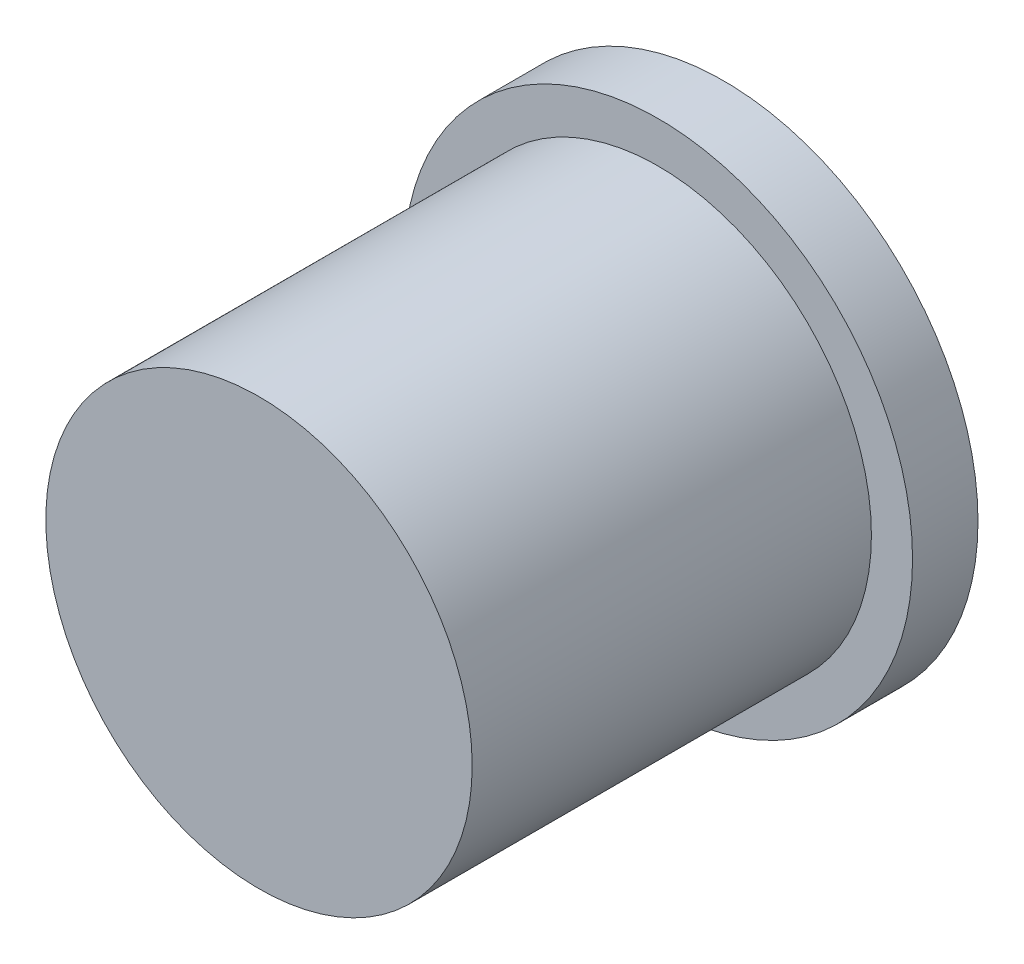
ISO-10303-21;
HEADER;
FILE_DESCRIPTION(('STEP AP214'),'2;1');
FILE_NAME('part.step','',(''),(''),'','','');
FILE_SCHEMA(('AUTOMOTIVE_DESIGN { 1 0 10303 214 1 1 1 1 }'));
ENDSEC;
DATA;
#1=APPLICATION_CONTEXT('core data for automotive mechanical design processes');
#2=APPLICATION_PROTOCOL_DEFINITION('international standard','automotive_design',2000,#1);
#3=PRODUCT_CONTEXT('',#1,'mechanical');
#4=PRODUCT('Part','Part','',(#3));
#5=PRODUCT_RELATED_PRODUCT_CATEGORY('part','',(#4));
#6=PRODUCT_DEFINITION_FORMATION('','',#4);
#7=PRODUCT_DEFINITION_CONTEXT('part definition',#1,'design');
#8=PRODUCT_DEFINITION('design','',#6,#7);
#9=PRODUCT_DEFINITION_SHAPE('','',#8);
#10=(LENGTH_UNIT() NAMED_UNIT(*) SI_UNIT(.MILLI.,.METRE.));
#11=(NAMED_UNIT(*) PLANE_ANGLE_UNIT() SI_UNIT($,.RADIAN.));
#12=(NAMED_UNIT(*) SI_UNIT($,.STERADIAN.) SOLID_ANGLE_UNIT());
#13=UNCERTAINTY_MEASURE_WITH_UNIT(LENGTH_MEASURE(1.E-05),#10,'distance_accuracy_value','');
#14=(GEOMETRIC_REPRESENTATION_CONTEXT(3) GLOBAL_UNCERTAINTY_ASSIGNED_CONTEXT((#13)) GLOBAL_UNIT_ASSIGNED_CONTEXT((#10,
#11,#12)) REPRESENTATION_CONTEXT('',''));
#15=CARTESIAN_POINT('',(0.,0.,0.));
#16=DIRECTION('',(0.,0.,1.));
#17=DIRECTION('',(1.,0.,0.));
#18=AXIS2_PLACEMENT_3D('',#15,#16,#17);
#19=CARTESIAN_POINT('',(0.,-2.54,10.9982));
#20=DIRECTION('',(0.,0.,-1.));
#21=DIRECTION('',(-1.,0.,0.));
#22=AXIS2_PLACEMENT_3D('',#19,#20,#21);
#23=PLANE('',#22);
#24=CARTESIAN_POINT('',(0.,-2.54,10.9982));
#25=DIRECTION('',(0.,0.,-1.));
#26=DIRECTION('',(-1.,0.,0.));
#27=AXIS2_PLACEMENT_3D('',#24,#25,#26);
#28=CIRCLE('',#27,3.048);
#29=CARTESIAN_POINT('',(-3.048,-2.54,10.9982));
#30=VERTEX_POINT('',#29);
#31=EDGE_CURVE('E49',#30,#30,#28,.T.);
#32=ORIENTED_EDGE('',*,*,#31,.T.);
#33=EDGE_LOOP('',(#32));
#34=FACE_BOUND('',#33,.T.);
#35=CARTESIAN_POINT('',(0.,-2.54,10.9982));
#36=DIRECTION('',(0.,0.,-1.));
#37=DIRECTION('',(-1.,0.,0.));
#38=AXIS2_PLACEMENT_3D('',#35,#36,#37);
#39=CIRCLE('',#38,1.27);
#40=CARTESIAN_POINT('',(-1.27,-2.54,10.9982));
#41=VERTEX_POINT('',#40);
#42=EDGE_CURVE('E57',#41,#41,#39,.T.);
#43=ORIENTED_EDGE('',*,*,#42,.F.);
#44=EDGE_LOOP('',(#43));
#45=FACE_BOUND('',#44,.T.);
#46=ADVANCED_FACE('F31',(#34,#45),#23,.T.);
#47=CARTESIAN_POINT('',(0.,0.,1.778));
#48=DIRECTION('',(0.,0.,1.));
#49=DIRECTION('',(1.,0.,0.));
#50=AXIS2_PLACEMENT_3D('',#47,#48,#49);
#51=PLANE('',#50);
#52=CARTESIAN_POINT('',(0.,0.,1.778));
#53=DIRECTION('',(0.,0.,1.));
#54=DIRECTION('',(1.,0.,0.));
#55=AXIS2_PLACEMENT_3D('',#52,#53,#54);
#56=CIRCLE('',#55,6.9088);
#57=CARTESIAN_POINT('',(6.9088,0.,1.778));
#58=VERTEX_POINT('',#57);
#59=EDGE_CURVE('E10',#58,#58,#56,.T.);
#60=ORIENTED_EDGE('',*,*,#59,.T.);
#61=EDGE_LOOP('',(#60));
#62=FACE_BOUND('',#61,.T.);
#63=CARTESIAN_POINT('',(0.,0.,1.778));
#64=DIRECTION('',(0.,0.,1.));
#65=DIRECTION('',(1.,0.,0.));
#66=AXIS2_PLACEMENT_3D('',#63,#64,#65);
#67=CIRCLE('',#66,5.7912);
#68=CARTESIAN_POINT('',(5.7912,0.,1.778));
#69=VERTEX_POINT('',#68);
#70=EDGE_CURVE('E46',#69,#69,#67,.T.);
#71=ORIENTED_EDGE('',*,*,#70,.F.);
#72=EDGE_LOOP('',(#71));
#73=FACE_BOUND('',#72,.T.);
#74=ADVANCED_FACE('F78',(#62,#73),#51,.T.);
#75=CARTESIAN_POINT('',(0.,0.,1.778));
#76=DIRECTION('',(0.,0.,-1.));
#77=DIRECTION('',(-1.,0.,0.));
#78=AXIS2_PLACEMENT_3D('',#75,#76,#77);
#79=CYLINDRICAL_SURFACE('',#78,6.9088);
#80=ORIENTED_EDGE('',*,*,#59,.F.);
#81=EDGE_LOOP('',(#80));
#82=FACE_BOUND('',#81,.T.);
#83=CARTESIAN_POINT('',(0.,0.,0.));
#84=DIRECTION('',(0.,0.,1.));
#85=DIRECTION('',(1.,0.,0.));
#86=AXIS2_PLACEMENT_3D('',#83,#84,#85);
#87=CIRCLE('',#86,6.9088);
#88=CARTESIAN_POINT('',(6.9088,0.,0.));
#89=VERTEX_POINT('',#88);
#90=EDGE_CURVE('E39',#89,#89,#87,.T.);
#91=ORIENTED_EDGE('',*,*,#90,.T.);
#92=EDGE_LOOP('',(#91));
#93=FACE_BOUND('',#92,.T.);
#94=ADVANCED_FACE('F83',(#82,#93),#79,.T.);
#95=CARTESIAN_POINT('',(0.,0.,0.));
#96=DIRECTION('',(0.,0.,1.));
#97=DIRECTION('',(1.,0.,0.));
#98=AXIS2_PLACEMENT_3D('',#95,#96,#97);
#99=PLANE('',#98);
#100=CARTESIAN_POINT('',(0.,-2.54,0.));
#101=DIRECTION('',(0.,0.,-1.));
#102=DIRECTION('',(-1.,0.,0.));
#103=AXIS2_PLACEMENT_3D('',#100,#101,#102);
#104=CIRCLE('',#103,3.048);
#105=CARTESIAN_POINT('',(-3.048,-2.54,0.));
#106=VERTEX_POINT('',#105);
#107=EDGE_CURVE('E52',#106,#106,#104,.T.);
#108=ORIENTED_EDGE('',*,*,#107,.F.);
#109=EDGE_LOOP('',(#108));
#110=FACE_BOUND('',#109,.T.);
#111=ORIENTED_EDGE('',*,*,#90,.F.);
#112=EDGE_LOOP('',(#111));
#113=FACE_BOUND('',#112,.T.);
#114=ADVANCED_FACE('F92',(#110,#113),#99,.F.);
#115=CARTESIAN_POINT('',(0.,0.,12.6238));
#116=DIRECTION('',(0.,0.,-1.));
#117=DIRECTION('',(-1.,0.,0.));
#118=AXIS2_PLACEMENT_3D('',#115,#116,#117);
#119=CYLINDRICAL_SURFACE('',#118,5.7912);
#120=CARTESIAN_POINT('',(0.,0.,12.6238));
#121=DIRECTION('',(0.,0.,1.));
#122=DIRECTION('',(1.,0.,0.));
#123=AXIS2_PLACEMENT_3D('',#120,#121,#122);
#124=CIRCLE('',#123,5.7912);
#125=CARTESIAN_POINT('',(5.7912,0.,12.6238));
#126=VERTEX_POINT('',#125);
#127=EDGE_CURVE('E44',#126,#126,#124,.T.);
#128=ORIENTED_EDGE('',*,*,#127,.F.);
#129=EDGE_LOOP('',(#128));
#130=FACE_BOUND('',#129,.T.);
#131=ORIENTED_EDGE('',*,*,#70,.T.);
#132=EDGE_LOOP('',(#131));
#133=FACE_BOUND('',#132,.T.);
#134=ADVANCED_FACE('F89',(#130,#133),#119,.T.);
#135=CARTESIAN_POINT('',(0.,0.,12.6238));
#136=DIRECTION('',(0.,0.,1.));
#137=DIRECTION('',(1.,0.,0.));
#138=AXIS2_PLACEMENT_3D('',#135,#136,#137);
#139=PLANE('',#138);
#140=ORIENTED_EDGE('',*,*,#127,.T.);
#141=EDGE_LOOP('',(#140));
#142=FACE_BOUND('',#141,.T.);
#143=ADVANCED_FACE('F73',(#142),#139,.T.);
#144=CARTESIAN_POINT('',(0.,-2.54,10.9982));
#145=DIRECTION('',(0.,0.,-1.));
#146=DIRECTION('',(-1.,0.,0.));
#147=AXIS2_PLACEMENT_3D('',#144,#145,#146);
#148=CYLINDRICAL_SURFACE('',#147,3.048);
#149=ORIENTED_EDGE('',*,*,#31,.F.);
#150=EDGE_LOOP('',(#149));
#151=FACE_BOUND('',#150,.T.);
#152=ORIENTED_EDGE('',*,*,#107,.T.);
#153=EDGE_LOOP('',(#152));
#154=FACE_BOUND('',#153,.T.);
#155=ADVANCED_FACE('F67',(#151,#154),#148,.F.);
#156=CARTESIAN_POINT('',(0.,-2.54,2.9972));
#157=DIRECTION('',(0.,0.,1.));
#158=DIRECTION('',(1.,0.,0.));
#159=AXIS2_PLACEMENT_3D('',#156,#157,#158);
#160=CYLINDRICAL_SURFACE('',#159,1.27);
#161=CARTESIAN_POINT('',(0.,-2.54,2.9972));
#162=DIRECTION('',(0.,0.,-1.));
#163=DIRECTION('',(-1.,0.,0.));
#164=AXIS2_PLACEMENT_3D('',#161,#162,#163);
#165=CIRCLE('',#164,1.27);
#166=CARTESIAN_POINT('',(-1.27,-2.54,2.9972));
#167=VERTEX_POINT('',#166);
#168=EDGE_CURVE('E35',#167,#167,#165,.T.);
#169=ORIENTED_EDGE('',*,*,#168,.F.);
#170=EDGE_LOOP('',(#169));
#171=FACE_BOUND('',#170,.T.);
#172=ORIENTED_EDGE('',*,*,#42,.T.);
#173=EDGE_LOOP('',(#172));
#174=FACE_BOUND('',#173,.T.);
#175=ADVANCED_FACE('F65',(#171,#174),#160,.T.);
#176=CARTESIAN_POINT('',(0.,-2.54,2.78603559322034));
#177=DIRECTION('',(0.,0.,1.));
#178=DIRECTION('',(1.,0.,0.));
#179=AXIS2_PLACEMENT_3D('',#176,#177,#178);
#180=SPHERICAL_SURFACE('',#179,1.28743559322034);
#181=ORIENTED_EDGE('',*,*,#168,.T.);
#182=EDGE_LOOP('',(#181));
#183=FACE_BOUND('',#182,.T.);
#184=ADVANCED_FACE('F33',(#183),#180,.T.);
#185=CLOSED_SHELL('',(#46,#74,#94,#114,#134,#143,#155,#175,#184));
#186=MANIFOLD_SOLID_BREP('B2',#185);
#187=ADVANCED_BREP_SHAPE_REPRESENTATION('',(#18,#186),#14);
#188=SHAPE_DEFINITION_REPRESENTATION(#9,#187);
ENDSEC;
END-ISO-10303-21;
